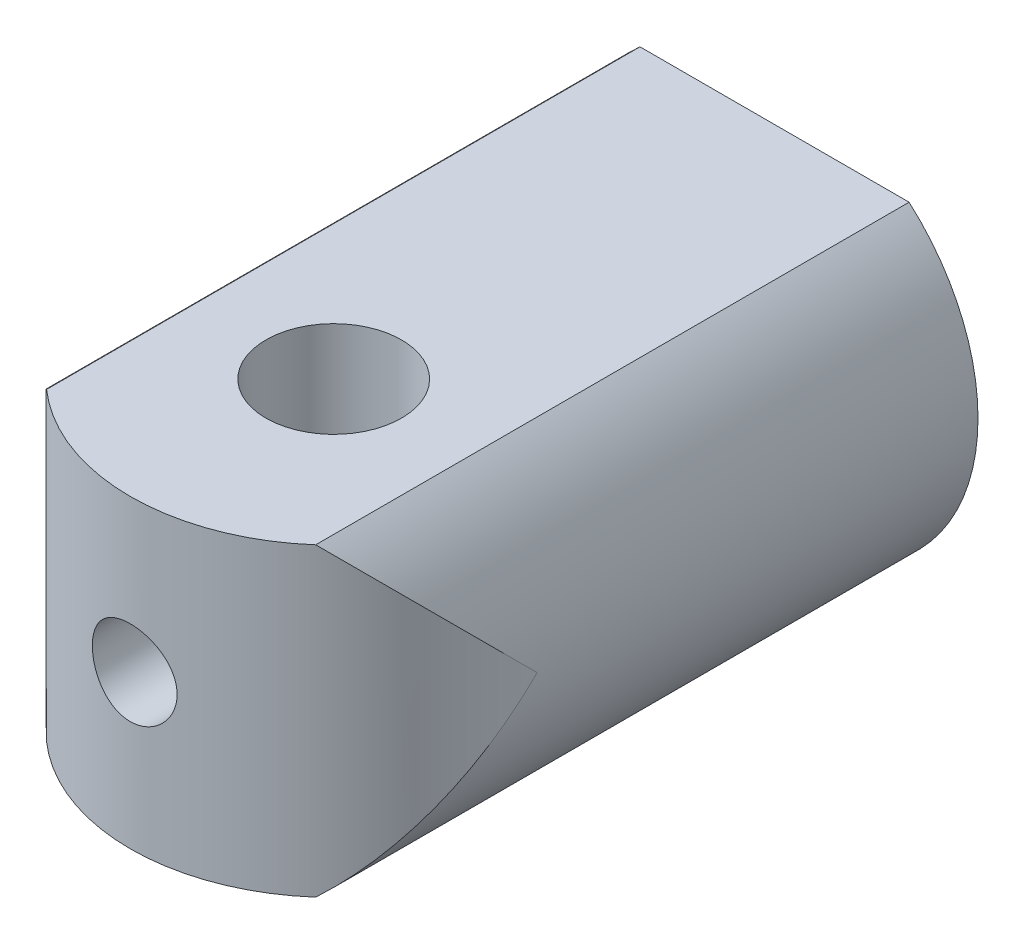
from build123d import *

# Parameters (mm, degrees)
ESQUISSE1_R                  = 12
EXTRUSION1_DEPTH             = 38
ENL_V_MAT_EXTRU_1_DEPTH      = 42.617304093
ENL_V_MAT_EXTRU_1_DEPTH_BACK = 42.617304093
ESQUISSE4_W                  = 98.570666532
ESQUISSE4_H                  = 120.245541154
ENL_V_MAT_EXTRU_3_DEPTH      = 46.044422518
TROU_TARAUD_M81_D            = 6.8
TROU_TARAUD_M81_DEPTH        = 16
TROU_TARAUD_M81_TIP          = 2.042926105
TROU_TARAUD_M61_D            = 5
TROU_TARAUD_M61_DEPTH        = 88
TROU_TARAUD_M61_TIP          = 1.502151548
ESQUISSE3_W                  = 60.333886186
ESQUISSE3_H                  = 123.328554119
EXTRUSION2_DEPTH             = 10
ESQUISSE11_R                 = 4
EXTRUSION3_DEPTH             = 44.726422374


with BuildPart() as part:
    # Esquisse1 → Extrusion1 (new body)
    with BuildSketch(Plane.XY):
        Circle(ESQUISSE1_R)
    extrude(amount=EXTRUSION1_DEPTH)

    # Esquisse2 → Enl_v. mat.-Extru.1 (cut, two sides: drawn at the far end of the back side and taken through both)
    with BuildSketch(Plane(origin=(0, 0, 0), x_dir=(1, 0, 0), z_dir=(0, 1, 0)).offset(-ENL_V_MAT_EXTRU_1_DEPTH_BACK)):
        with BuildLine():
            Line((-12, -26), (-34.318270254, -113.684507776))
            Line((-34.318270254, -113.684507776), (-13.173461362, -135.331599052))
            Line((-13.173461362, -135.331599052), (33.111498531, -137.324615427))
            Line((33.111498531, -137.324615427), (30.932382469, -133.338582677))
            Line((30.932382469, -133.338582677), (12, -26))
            ThreePointArc((12, -26), (0, -38), (-12, -26))
        make_face()
    extrude(amount=ENL_V_MAT_EXTRU_1_DEPTH + ENL_V_MAT_EXTRU_1_DEPTH_BACK, mode=Mode.SUBTRACT)

    # Esquisse4 → Enl_v. mat.-Extru.3 (cut, through all)
    with BuildSketch(Plane(origin=(0, -9, 0), x_dir=(-1, 0, 0), z_dir=(0, 1, 0))):
        with Locations((2.936500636, 56.450120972)):
            Rectangle(ESQUISSE4_W, ESQUISSE4_H)
    extrude(amount=-ENL_V_MAT_EXTRU_3_DEPTH, mode=Mode.SUBTRACT)

    # Trou taraud_ M81
    with Locations(Plane(origin=(0, 0, 0), x_dir=(-1, 0, 0), z_dir=(0, 0, -1))):
        with Locations((0, 0)):
            Hole(TROU_TARAUD_M81_D / 2, depth=TROU_TARAUD_M81_DEPTH)
            with Locations((0, 0, -(TROU_TARAUD_M81_DEPTH + TROU_TARAUD_M81_TIP / 2))):  # 118° drill point
                Cone(0, TROU_TARAUD_M81_D / 2, TROU_TARAUD_M81_TIP, mode=Mode.SUBTRACT)

    # Trou taraud_ M61
    with Locations(Plane.XY.offset(114)):
        with Locations((0, 0)):
            Hole(TROU_TARAUD_M61_D / 2, depth=TROU_TARAUD_M61_DEPTH)
            with Locations((0, 0, -(TROU_TARAUD_M61_DEPTH + TROU_TARAUD_M61_TIP / 2))):  # 118° drill point
                Cone(0, TROU_TARAUD_M61_D / 2, TROU_TARAUD_M61_TIP, mode=Mode.SUBTRACT)

    # Esquisse3 → Extrusion2 (cut)
    with BuildSketch(Plane(origin=(0, 9, 0), x_dir=(-1, 0, 0), z_dir=(0, 1, 0))):
        with Locations((-0.718371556, 57.295316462)):
            Rectangle(ESQUISSE3_W, ESQUISSE3_H)
    extrude(amount=EXTRUSION2_DEPTH, mode=Mode.SUBTRACT)

    # Esquisse11 → Extrusion3 (cut, through all)
    with BuildSketch(Plane(origin=(0, 9, 0), x_dir=(1, 0, 0), z_dir=(0, 1, 0))):
        with Locations(Location((0, -26, 0), (0, 0, 270))):
            Circle(ESQUISSE11_R)
    extrude(amount=-EXTRUSION3_DEPTH, mode=Mode.SUBTRACT)


solid = part.part
